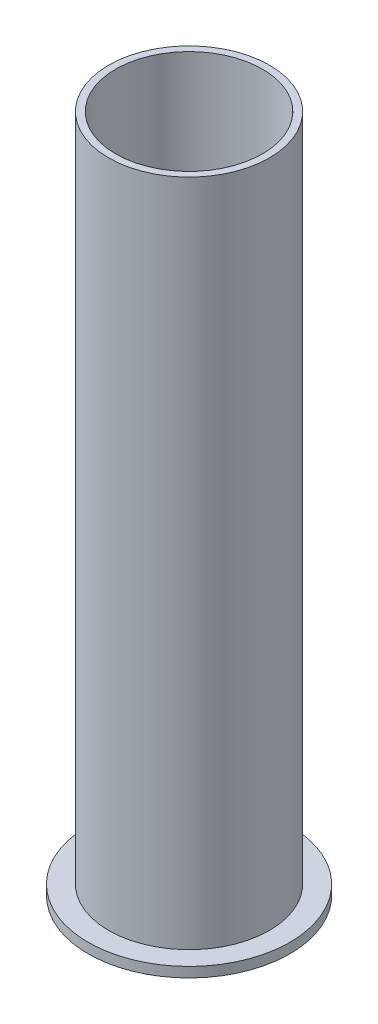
from build123d import *

# Parameters (mm, degrees)
SKETCH1_R           = 6.3246
SKETCH1_R_2         = 5.7785
BOSS_EXTRUDE1_DEPTH = 53.4416
SKETCH2_R           = 7.9375
SKETCH2_R_2         = 5.7785
BOSS_EXTRUDE2_DEPTH = 0.7874


with BuildPart() as part:
    # Sketch1 → Boss-Extrude1 (new body)
    with BuildSketch(Plane(origin=(0, 0, 0), x_dir=(1, 0, 0), z_dir=(0, 1, 0))):
        with Locations(Location((0, 0, 0), (0, 0, 270))):
            Circle(SKETCH1_R)
        with Locations(Location((0, 0, 0), (0, 0, 270))):
            Circle(SKETCH1_R_2, mode=Mode.SUBTRACT)
    extrude(amount=BOSS_EXTRUDE1_DEPTH)

    # Sketch2 → Boss-Extrude2 (add)
    with BuildSketch(Plane.XZ):
        with Locations(Location((0, 0, 0), (0, 0, 270))):
            Circle(SKETCH2_R)
        with Locations(Location((0, 0, 0), (0, 0, 90))):
            Circle(SKETCH2_R_2, mode=Mode.SUBTRACT)
    extrude(amount=-BOSS_EXTRUDE2_DEPTH)


solid = part.part
